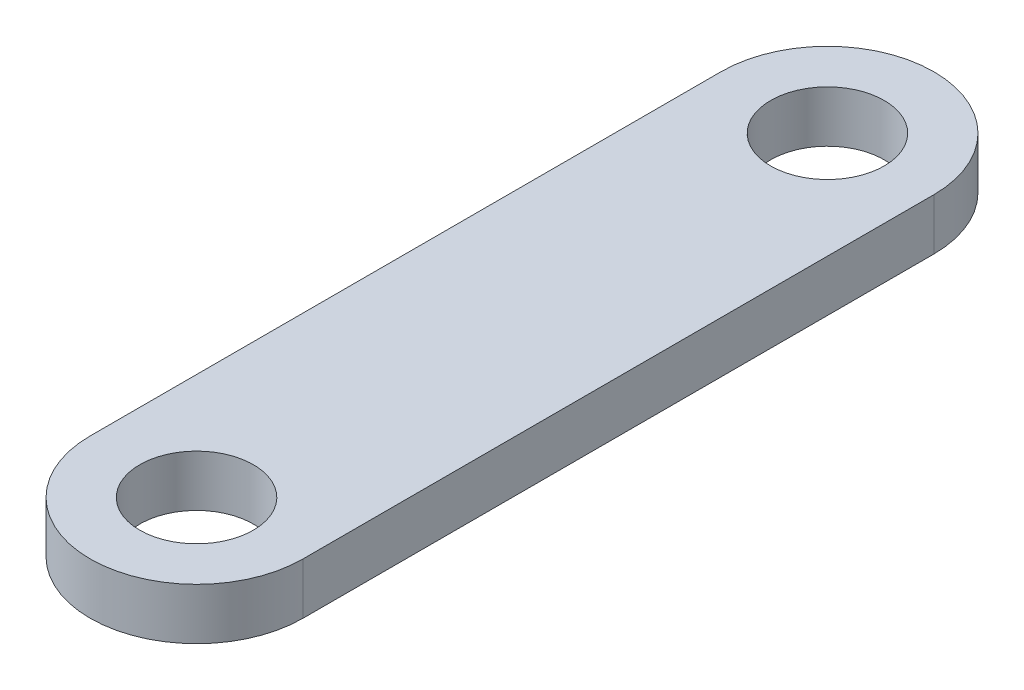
ISO-10303-21;
HEADER;
FILE_DESCRIPTION(('STEP AP214'),'2;1');
FILE_NAME('part.step','',(''),(''),'','','');
FILE_SCHEMA(('AUTOMOTIVE_DESIGN { 1 0 10303 214 1 1 1 1 }'));
ENDSEC;
DATA;
#1=APPLICATION_CONTEXT('core data for automotive mechanical design processes');
#2=APPLICATION_PROTOCOL_DEFINITION('international standard','automotive_design',2000,#1);
#3=PRODUCT_CONTEXT('',#1,'mechanical');
#4=PRODUCT('Part','Part','',(#3));
#5=PRODUCT_RELATED_PRODUCT_CATEGORY('part','',(#4));
#6=PRODUCT_DEFINITION_FORMATION('','',#4);
#7=PRODUCT_DEFINITION_CONTEXT('part definition',#1,'design');
#8=PRODUCT_DEFINITION('design','',#6,#7);
#9=PRODUCT_DEFINITION_SHAPE('','',#8);
#10=(LENGTH_UNIT() NAMED_UNIT(*) SI_UNIT(.MILLI.,.METRE.));
#11=(NAMED_UNIT(*) PLANE_ANGLE_UNIT() SI_UNIT($,.RADIAN.));
#12=(NAMED_UNIT(*) SI_UNIT($,.STERADIAN.) SOLID_ANGLE_UNIT());
#13=UNCERTAINTY_MEASURE_WITH_UNIT(LENGTH_MEASURE(1.E-05),#10,'distance_accuracy_value','');
#14=(GEOMETRIC_REPRESENTATION_CONTEXT(3) GLOBAL_UNCERTAINTY_ASSIGNED_CONTEXT((#13)) GLOBAL_UNIT_ASSIGNED_CONTEXT((#10,
#11,#12)) REPRESENTATION_CONTEXT('',''));
#15=CARTESIAN_POINT('',(0.,0.,0.));
#16=DIRECTION('',(0.,0.,1.));
#17=DIRECTION('',(1.,0.,0.));
#18=AXIS2_PLACEMENT_3D('',#15,#16,#17);
#19=CARTESIAN_POINT('',(0.,2.07,0.));
#20=DIRECTION('',(0.,-1.,0.));
#21=DIRECTION('',(0.,0.,-1.));
#22=AXIS2_PLACEMENT_3D('',#19,#20,#21);
#23=PLANE('',#22);
#24=CARTESIAN_POINT('',(0.,2.07,0.));
#25=DIRECTION('',(0.,1.,0.));
#26=DIRECTION('',(0.,0.,-1.));
#27=AXIS2_PLACEMENT_3D('',#24,#25,#26);
#28=CIRCLE('',#27,4.28641686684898);
#29=CARTESIAN_POINT('',(-4.28641686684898,2.07,0.));
#30=VERTEX_POINT('',#29);
#31=CARTESIAN_POINT('',(4.28641686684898,2.07,0.));
#32=VERTEX_POINT('',#31);
#33=EDGE_CURVE('E89',#30,#32,#28,.T.);
#34=ORIENTED_EDGE('',*,*,#33,.T.);
#35=DIRECTION('',(0.,0.,-1.));
#36=VECTOR('',#35,1.);
#37=CARTESIAN_POINT('',(4.28641686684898,2.07,-25.4));
#38=LINE('',#37,#36);
#39=CARTESIAN_POINT('',(4.28641686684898,2.07,-25.4));
#40=VERTEX_POINT('',#39);
#41=EDGE_CURVE('E84',#32,#40,#38,.T.);
#42=ORIENTED_EDGE('',*,*,#41,.T.);
#43=CARTESIAN_POINT('',(0.,2.07,-25.4));
#44=DIRECTION('',(0.,1.,0.));
#45=DIRECTION('',(0.,0.,-1.));
#46=AXIS2_PLACEMENT_3D('',#43,#44,#45);
#47=CIRCLE('',#46,4.28641686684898);
#48=CARTESIAN_POINT('',(-4.28641686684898,2.07,-25.4));
#49=VERTEX_POINT('',#48);
#50=EDGE_CURVE('E87',#40,#49,#47,.T.);
#51=ORIENTED_EDGE('',*,*,#50,.T.);
#52=DIRECTION('',(0.,0.,1.));
#53=VECTOR('',#52,1.);
#54=CARTESIAN_POINT('',(-4.28641686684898,2.07,0.));
#55=LINE('',#54,#53);
#56=EDGE_CURVE('E54',#49,#30,#55,.T.);
#57=ORIENTED_EDGE('',*,*,#56,.T.);
#58=EDGE_LOOP('',(#34,#42,#51,#57));
#59=FACE_BOUND('',#58,.T.);
#60=CARTESIAN_POINT('',(0.,2.07,0.));
#61=DIRECTION('',(0.,1.,0.));
#62=DIRECTION('',(0.,0.,1.));
#63=AXIS2_PLACEMENT_3D('',#60,#61,#62);
#64=CIRCLE('',#63,2.286);
#65=CARTESIAN_POINT('',(0.,2.07,2.286));
#66=VERTEX_POINT('',#65);
#67=EDGE_CURVE('E104',#66,#66,#64,.T.);
#68=ORIENTED_EDGE('',*,*,#67,.F.);
#69=EDGE_LOOP('',(#68));
#70=FACE_BOUND('',#69,.T.);
#71=CARTESIAN_POINT('',(0.,2.07,-25.4));
#72=DIRECTION('',(0.,1.,0.));
#73=DIRECTION('',(0.,0.,1.));
#74=AXIS2_PLACEMENT_3D('',#71,#72,#73);
#75=CIRCLE('',#74,2.286);
#76=CARTESIAN_POINT('',(0.,2.07,-23.114));
#77=VERTEX_POINT('',#76);
#78=EDGE_CURVE('E119',#77,#77,#75,.T.);
#79=ORIENTED_EDGE('',*,*,#78,.F.);
#80=EDGE_LOOP('',(#79));
#81=FACE_BOUND('',#80,.T.);
#82=ADVANCED_FACE('F37',(#59,#70,#81),#23,.F.);
#83=CARTESIAN_POINT('',(0.,0.,0.));
#84=DIRECTION('',(0.,-1.,0.));
#85=DIRECTION('',(0.,0.,-1.));
#86=AXIS2_PLACEMENT_3D('',#83,#84,#85);
#87=PLANE('',#86);
#88=CARTESIAN_POINT('',(0.,0.,0.));
#89=DIRECTION('',(0.,1.,0.));
#90=DIRECTION('',(0.,0.,1.));
#91=AXIS2_PLACEMENT_3D('',#88,#89,#90);
#92=CIRCLE('',#91,2.286);
#93=CARTESIAN_POINT('',(0.,0.,2.286));
#94=VERTEX_POINT('',#93);
#95=EDGE_CURVE('E116',#94,#94,#92,.T.);
#96=ORIENTED_EDGE('',*,*,#95,.T.);
#97=EDGE_LOOP('',(#96));
#98=FACE_BOUND('',#97,.T.);
#99=CARTESIAN_POINT('',(0.,0.,0.));
#100=DIRECTION('',(0.,1.,0.));
#101=DIRECTION('',(0.,0.,-1.));
#102=AXIS2_PLACEMENT_3D('',#99,#100,#101);
#103=CIRCLE('',#102,4.28641686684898);
#104=CARTESIAN_POINT('',(-4.28641686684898,0.,0.));
#105=VERTEX_POINT('',#104);
#106=CARTESIAN_POINT('',(4.28641686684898,0.,0.));
#107=VERTEX_POINT('',#106);
#108=EDGE_CURVE('E101',#105,#107,#103,.T.);
#109=ORIENTED_EDGE('',*,*,#108,.F.);
#110=DIRECTION('',(0.,0.,1.));
#111=VECTOR('',#110,1.);
#112=CARTESIAN_POINT('',(-4.28641686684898,0.,0.));
#113=LINE('',#112,#111);
#114=CARTESIAN_POINT('',(-4.28641686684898,0.,-25.4));
#115=VERTEX_POINT('',#114);
#116=EDGE_CURVE('E77',#115,#105,#113,.T.);
#117=ORIENTED_EDGE('',*,*,#116,.F.);
#118=CARTESIAN_POINT('',(0.,0.,-25.4));
#119=DIRECTION('',(0.,1.,0.));
#120=DIRECTION('',(0.,0.,-1.));
#121=AXIS2_PLACEMENT_3D('',#118,#119,#120);
#122=CIRCLE('',#121,4.28641686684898);
#123=CARTESIAN_POINT('',(4.28641686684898,0.,-25.4));
#124=VERTEX_POINT('',#123);
#125=EDGE_CURVE('E71',#124,#115,#122,.T.);
#126=ORIENTED_EDGE('',*,*,#125,.F.);
#127=DIRECTION('',(0.,0.,-1.));
#128=VECTOR('',#127,1.);
#129=CARTESIAN_POINT('',(4.28641686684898,0.,-25.4));
#130=LINE('',#129,#128);
#131=EDGE_CURVE('E93',#107,#124,#130,.T.);
#132=ORIENTED_EDGE('',*,*,#131,.F.);
#133=EDGE_LOOP('',(#109,#117,#126,#132));
#134=FACE_BOUND('',#133,.T.);
#135=CARTESIAN_POINT('',(0.,0.,-25.4));
#136=DIRECTION('',(0.,1.,0.));
#137=DIRECTION('',(0.,0.,1.));
#138=AXIS2_PLACEMENT_3D('',#135,#136,#137);
#139=CIRCLE('',#138,2.286);
#140=CARTESIAN_POINT('',(0.,0.,-23.114));
#141=VERTEX_POINT('',#140);
#142=EDGE_CURVE('E122',#141,#141,#139,.T.);
#143=ORIENTED_EDGE('',*,*,#142,.T.);
#144=EDGE_LOOP('',(#143));
#145=FACE_BOUND('',#144,.T.);
#146=ADVANCED_FACE('F112',(#98,#134,#145),#87,.T.);
#147=CARTESIAN_POINT('',(0.,2.07,0.));
#148=DIRECTION('',(0.,-1.,0.));
#149=DIRECTION('',(0.,0.,-1.));
#150=AXIS2_PLACEMENT_3D('',#147,#148,#149);
#151=CYLINDRICAL_SURFACE('',#150,4.28641686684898);
#152=ORIENTED_EDGE('',*,*,#108,.T.);
#153=DIRECTION('',(0.,-1.,0.));
#154=VECTOR('',#153,1.);
#155=CARTESIAN_POINT('',(4.28641686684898,2.07,0.));
#156=LINE('',#155,#154);
#157=EDGE_CURVE('E11',#32,#107,#156,.T.);
#158=ORIENTED_EDGE('',*,*,#157,.F.);
#159=ORIENTED_EDGE('',*,*,#33,.F.);
#160=DIRECTION('',(0.,-1.,0.));
#161=VECTOR('',#160,1.);
#162=CARTESIAN_POINT('',(-4.28641686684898,2.07,0.));
#163=LINE('',#162,#161);
#164=EDGE_CURVE('E97',#30,#105,#163,.T.);
#165=ORIENTED_EDGE('',*,*,#164,.T.);
#166=EDGE_LOOP('',(#152,#158,#159,#165));
#167=FACE_BOUND('',#166,.T.);
#168=ADVANCED_FACE('F39',(#167),#151,.T.);
#169=CARTESIAN_POINT('',(4.28641686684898,2.07,-25.4));
#170=DIRECTION('',(-1.,0.,0.));
#171=DIRECTION('',(0.,0.,1.));
#172=AXIS2_PLACEMENT_3D('',#169,#170,#171);
#173=PLANE('',#172);
#174=ORIENTED_EDGE('',*,*,#131,.T.);
#175=DIRECTION('',(0.,-1.,0.));
#176=VECTOR('',#175,1.);
#177=CARTESIAN_POINT('',(4.28641686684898,2.07,-25.4));
#178=LINE('',#177,#176);
#179=EDGE_CURVE('E46',#40,#124,#178,.T.);
#180=ORIENTED_EDGE('',*,*,#179,.F.);
#181=ORIENTED_EDGE('',*,*,#41,.F.);
#182=ORIENTED_EDGE('',*,*,#157,.T.);
#183=EDGE_LOOP('',(#174,#180,#181,#182));
#184=FACE_BOUND('',#183,.T.);
#185=ADVANCED_FACE('F92',(#184),#173,.F.);
#186=CARTESIAN_POINT('',(0.,2.07,-25.4));
#187=DIRECTION('',(0.,-1.,0.));
#188=DIRECTION('',(0.,0.,-1.));
#189=AXIS2_PLACEMENT_3D('',#186,#187,#188);
#190=CYLINDRICAL_SURFACE('',#189,4.28641686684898);
#191=ORIENTED_EDGE('',*,*,#125,.T.);
#192=DIRECTION('',(0.,-1.,0.));
#193=VECTOR('',#192,1.);
#194=CARTESIAN_POINT('',(-4.28641686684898,2.07,-25.4));
#195=LINE('',#194,#193);
#196=EDGE_CURVE('E94',#49,#115,#195,.T.);
#197=ORIENTED_EDGE('',*,*,#196,.F.);
#198=ORIENTED_EDGE('',*,*,#50,.F.);
#199=ORIENTED_EDGE('',*,*,#179,.T.);
#200=EDGE_LOOP('',(#191,#197,#198,#199));
#201=FACE_BOUND('',#200,.T.);
#202=ADVANCED_FACE('F95',(#201),#190,.T.);
#203=CARTESIAN_POINT('',(-4.28641686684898,2.07,0.));
#204=DIRECTION('',(1.,0.,0.));
#205=DIRECTION('',(0.,0.,-1.));
#206=AXIS2_PLACEMENT_3D('',#203,#204,#205);
#207=PLANE('',#206);
#208=ORIENTED_EDGE('',*,*,#116,.T.);
#209=ORIENTED_EDGE('',*,*,#164,.F.);
#210=ORIENTED_EDGE('',*,*,#56,.F.);
#211=ORIENTED_EDGE('',*,*,#196,.T.);
#212=EDGE_LOOP('',(#208,#209,#210,#211));
#213=FACE_BOUND('',#212,.T.);
#214=ADVANCED_FACE('F109',(#213),#207,.F.);
#215=CARTESIAN_POINT('',(0.,2.07,0.));
#216=DIRECTION('',(0.,-1.,0.));
#217=DIRECTION('',(0.,0.,-1.));
#218=AXIS2_PLACEMENT_3D('',#215,#216,#217);
#219=CYLINDRICAL_SURFACE('',#218,2.286);
#220=ORIENTED_EDGE('',*,*,#67,.T.);
#221=EDGE_LOOP('',(#220));
#222=FACE_BOUND('',#221,.T.);
#223=ORIENTED_EDGE('',*,*,#95,.F.);
#224=EDGE_LOOP('',(#223));
#225=FACE_BOUND('',#224,.T.);
#226=ADVANCED_FACE('F139',(#222,#225),#219,.F.);
#227=CARTESIAN_POINT('',(0.,2.07,-25.4));
#228=DIRECTION('',(0.,-1.,0.));
#229=DIRECTION('',(0.,0.,-1.));
#230=AXIS2_PLACEMENT_3D('',#227,#228,#229);
#231=CYLINDRICAL_SURFACE('',#230,2.286);
#232=ORIENTED_EDGE('',*,*,#78,.T.);
#233=EDGE_LOOP('',(#232));
#234=FACE_BOUND('',#233,.T.);
#235=ORIENTED_EDGE('',*,*,#142,.F.);
#236=EDGE_LOOP('',(#235));
#237=FACE_BOUND('',#236,.T.);
#238=ADVANCED_FACE('F128',(#234,#237),#231,.F.);
#239=CLOSED_SHELL('',(#82,#146,#168,#185,#202,#214,#226,#238));
#240=MANIFOLD_SOLID_BREP('B2',#239);
#241=ADVANCED_BREP_SHAPE_REPRESENTATION('',(#18,#240),#14);
#242=SHAPE_DEFINITION_REPRESENTATION(#9,#241);
ENDSEC;
END-ISO-10303-21;
